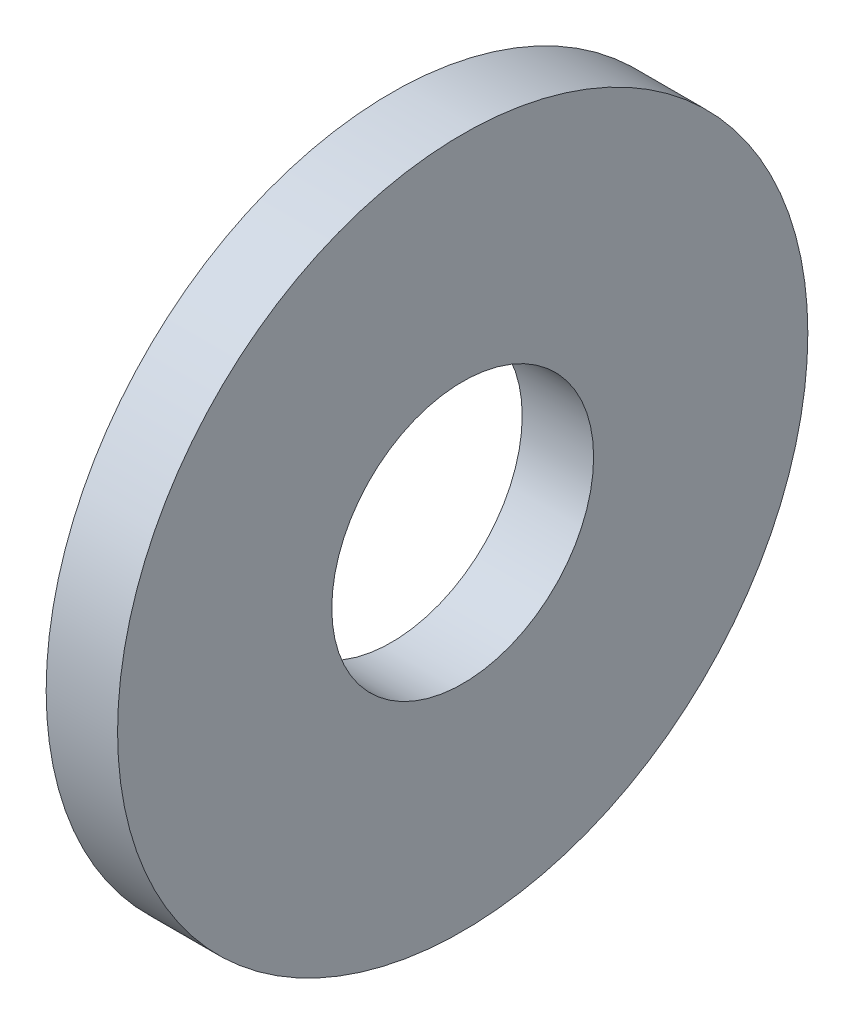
from build123d import *

# Parameters (mm, degrees)
SKETCH1_R          = 14.5
SKETCH1_R_2        = 5.5
BASE_EXTRUDE_DEPTH = 3


with BuildPart() as part:
    # Sketch1 → Base-Extrude (new body)
    with BuildSketch(Plane(origin=(0, 0, 0), x_dir=(0, 0, -1), z_dir=(1, 0, 0))):
        Circle(SKETCH1_R)
        Circle(SKETCH1_R_2, mode=Mode.SUBTRACT)
    extrude(amount=BASE_EXTRUDE_DEPTH)


solid = part.part
